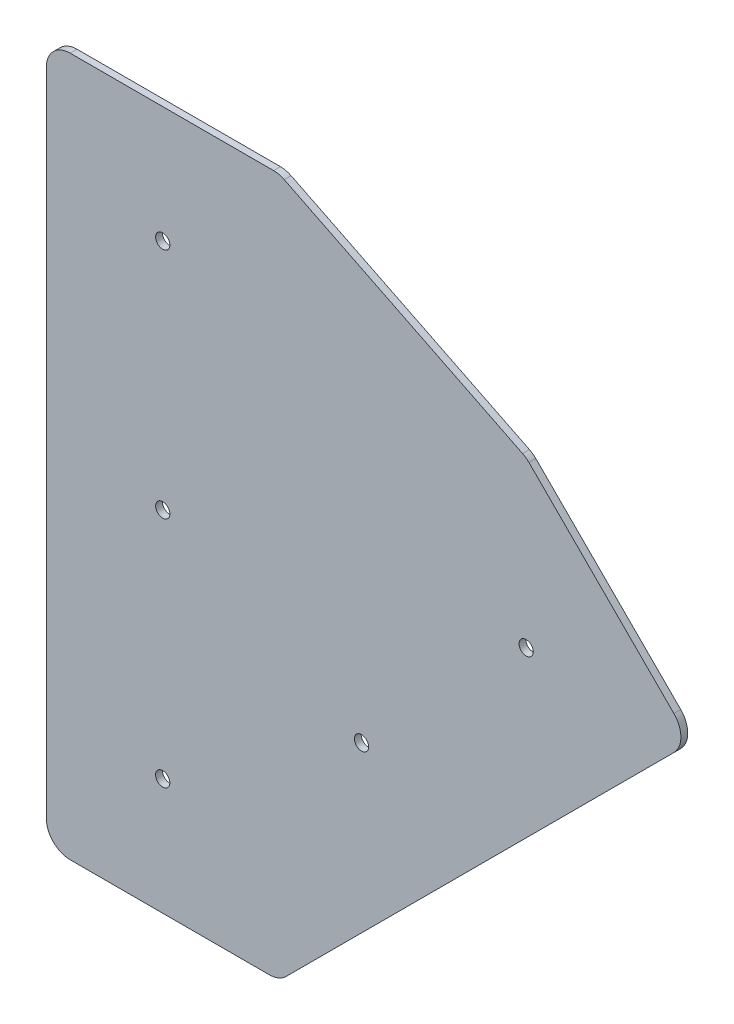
ISO-10303-21;
HEADER;
FILE_DESCRIPTION(('STEP AP214'),'2;1');
FILE_NAME('part.step','',(''),(''),'','','');
FILE_SCHEMA(('AUTOMOTIVE_DESIGN { 1 0 10303 214 1 1 1 1 }'));
ENDSEC;
DATA;
#1=APPLICATION_CONTEXT('core data for automotive mechanical design processes');
#2=APPLICATION_PROTOCOL_DEFINITION('international standard','automotive_design',2000,#1);
#3=PRODUCT_CONTEXT('',#1,'mechanical');
#4=PRODUCT('Part','Part','',(#3));
#5=PRODUCT_RELATED_PRODUCT_CATEGORY('part','',(#4));
#6=PRODUCT_DEFINITION_FORMATION('','',#4);
#7=PRODUCT_DEFINITION_CONTEXT('part definition',#1,'design');
#8=PRODUCT_DEFINITION('design','',#6,#7);
#9=PRODUCT_DEFINITION_SHAPE('','',#8);
#10=(LENGTH_UNIT() NAMED_UNIT(*) SI_UNIT(.MILLI.,.METRE.));
#11=(NAMED_UNIT(*) PLANE_ANGLE_UNIT() SI_UNIT($,.RADIAN.));
#12=(NAMED_UNIT(*) SI_UNIT($,.STERADIAN.) SOLID_ANGLE_UNIT());
#13=UNCERTAINTY_MEASURE_WITH_UNIT(LENGTH_MEASURE(1.E-05),#10,'distance_accuracy_value','');
#14=(GEOMETRIC_REPRESENTATION_CONTEXT(3) GLOBAL_UNCERTAINTY_ASSIGNED_CONTEXT((#13)) GLOBAL_UNIT_ASSIGNED_CONTEXT((#10,
#11,#12)) REPRESENTATION_CONTEXT('',''));
#15=CARTESIAN_POINT('',(0.,0.,0.));
#16=DIRECTION('',(0.,0.,1.));
#17=DIRECTION('',(1.,0.,0.));
#18=AXIS2_PLACEMENT_3D('',#15,#16,#17);
#19=CARTESIAN_POINT('',(111.8696307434,132.9358118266,0.));
#20=DIRECTION('',(-0.707106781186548,-0.707106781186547,0.));
#21=DIRECTION('',(0.707106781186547,-0.707106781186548,0.));
#22=AXIS2_PLACEMENT_3D('',#19,#20,#21);
#23=PLANE('',#22);
#24=DIRECTION('',(0.,0.,-1.));
#25=VECTOR('',#24,1.);
#26=CARTESIAN_POINT('',(111.869630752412,132.935811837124,0.79375));
#27=LINE('',#26,#25);
#28=CARTESIAN_POINT('',(111.869630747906,132.935811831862,0.));
#29=VERTEX_POINT('',#28);
#30=CARTESIAN_POINT('',(111.869630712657,132.93581180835,1.5875));
#31=VERTEX_POINT('',#30);
#32=EDGE_CURVE('E158',#29,#31,#27,.F.);
#33=ORIENTED_EDGE('',*,*,#32,.T.);
#34=DIRECTION('',(-0.707106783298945,0.70710677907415,0.));
#35=VECTOR('',#34,1.);
#36=CARTESIAN_POINT('',(145.461359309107,99.344083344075,1.5875));
#37=LINE('',#36,#35);
#38=CARTESIAN_POINT('',(145.461359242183,99.3440833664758,1.5875));
#39=VERTEX_POINT('',#38);
#40=EDGE_CURVE('E192',#39,#31,#37,.T.);
#41=ORIENTED_EDGE('',*,*,#40,.F.);
#42=DIRECTION('',(0.,0.,1.));
#43=VECTOR('',#42,1.);
#44=CARTESIAN_POINT('',(145.461359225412,99.3440833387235,0.79375));
#45=LINE('',#44,#43);
#46=CARTESIAN_POINT('',(145.461359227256,99.3440833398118,0.));
#47=VERTEX_POINT('',#46);
#48=EDGE_CURVE('E130',#39,#47,#45,.F.);
#49=ORIENTED_EDGE('',*,*,#48,.T.);
#50=DIRECTION('',(0.707106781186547,-0.707106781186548,0.));
#51=VECTOR('',#50,1.);
#52=CARTESIAN_POINT('',(111.8696307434,132.9358118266,0.));
#53=LINE('',#52,#51);
#54=EDGE_CURVE('E211',#47,#29,#53,.F.);
#55=ORIENTED_EDGE('',*,*,#54,.T.);
#56=EDGE_LOOP('',(#33,#41,#49,#55));
#57=FACE_BOUND('',#56,.T.);
#58=ADVANCED_FACE('F15',(#57),#23,.F.);
#59=CARTESIAN_POINT('',(107.9407687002,129.0069497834,1.5875));
#60=DIRECTION('',(0.,0.,-1.));
#61=DIRECTION('',(0.,1.,0.));
#62=AXIS2_PLACEMENT_3D('',#59,#60,#61);
#63=CYLINDRICAL_SURFACE('',#62,5.55625000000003);
#64=ORIENTED_EDGE('',*,*,#32,.F.);
#65=CARTESIAN_POINT('',(107.9407687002,129.0069497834,0.));
#66=DIRECTION('',(0.,0.,-1.));
#67=DIRECTION('',(0.,1.,0.));
#68=AXIS2_PLACEMENT_3D('',#65,#66,#67);
#69=CIRCLE('',#68,5.55625000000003);
#70=CARTESIAN_POINT('',(110.406036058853,133.986344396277,0.));
#71=VERTEX_POINT('',#70);
#72=EDGE_CURVE('E208',#29,#71,#69,.F.);
#73=ORIENTED_EDGE('',*,*,#72,.T.);
#74=DIRECTION('',(0.,0.,1.));
#75=VECTOR('',#74,1.);
#76=CARTESIAN_POINT('',(110.4060360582,133.9863443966,0.79375));
#77=LINE('',#76,#75);
#78=CARTESIAN_POINT('',(110.40603606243,133.986344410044,1.5875));
#79=VERTEX_POINT('',#78);
#80=EDGE_CURVE('E155',#71,#79,#77,.T.);
#81=ORIENTED_EDGE('',*,*,#80,.T.);
#82=CARTESIAN_POINT('',(107.9407687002,129.0069497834,1.5875));
#83=DIRECTION('',(0.,0.,-1.));
#84=DIRECTION('',(0.,1.,0.));
#85=AXIS2_PLACEMENT_3D('',#82,#83,#84);
#86=CIRCLE('',#85,5.55625000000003);
#87=EDGE_CURVE('E190',#31,#79,#86,.F.);
#88=ORIENTED_EDGE('',*,*,#87,.F.);
#89=EDGE_LOOP('',(#64,#73,#81,#88));
#90=FACE_BOUND('',#89,.T.);
#91=ADVANCED_FACE('F294',(#90),#63,.T.);
#92=CARTESIAN_POINT('',(55.1401436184,161.3481446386,0.));
#93=DIRECTION('',(-0.443692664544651,-0.896179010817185,0.));
#94=DIRECTION('',(0.896179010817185,-0.443692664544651,0.));
#95=AXIS2_PLACEMENT_3D('',#92,#93,#94);
#96=PLANE('',#95);
#97=ORIENTED_EDGE('',*,*,#80,.F.);
#98=DIRECTION('',(0.896179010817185,-0.443692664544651,0.));
#99=VECTOR('',#98,1.);
#100=CARTESIAN_POINT('',(55.1401436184,161.3481446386,0.));
#101=LINE('',#100,#99);
#102=CARTESIAN_POINT('',(55.1401436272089,161.348144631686,0.));
#103=VERTEX_POINT('',#102);
#104=EDGE_CURVE('E206',#71,#103,#101,.F.);
#105=ORIENTED_EDGE('',*,*,#104,.T.);
#106=DIRECTION('',(0.,0.,-1.));
#107=VECTOR('',#106,1.);
#108=CARTESIAN_POINT('',(55.1401436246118,161.34814463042,0.79375));
#109=LINE('',#108,#107);
#110=CARTESIAN_POINT('',(55.1401436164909,161.34814461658,1.5875));
#111=VERTEX_POINT('',#110);
#112=EDGE_CURVE('E103',#103,#111,#109,.F.);
#113=ORIENTED_EDGE('',*,*,#112,.T.);
#114=DIRECTION('',(-0.896179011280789,0.443692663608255,0.));
#115=VECTOR('',#114,1.);
#116=CARTESIAN_POINT('',(110.406036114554,133.986344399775,1.5875));
#117=LINE('',#116,#115);
#118=EDGE_CURVE('E188',#79,#111,#117,.T.);
#119=ORIENTED_EDGE('',*,*,#118,.F.);
#120=EDGE_LOOP('',(#97,#105,#113,#119));
#121=FACE_BOUND('',#120,.T.);
#122=ADVANCED_FACE('F293',(#121),#96,.F.);
#123=CARTESIAN_POINT('',(52.6748762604,156.36875,1.5875));
#124=DIRECTION('',(0.,0.,-1.));
#125=DIRECTION('',(0.,1.,0.));
#126=AXIS2_PLACEMENT_3D('',#123,#124,#125);
#127=CYLINDRICAL_SURFACE('',#126,5.55625);
#128=ORIENTED_EDGE('',*,*,#112,.F.);
#129=CARTESIAN_POINT('',(52.6748762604,156.36875,0.));
#130=DIRECTION('',(0.,0.,-1.));
#131=DIRECTION('',(0.,1.,0.));
#132=AXIS2_PLACEMENT_3D('',#129,#130,#131);
#133=CIRCLE('',#132,5.55625);
#134=CARTESIAN_POINT('',(52.6748762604,161.925,0.));
#135=VERTEX_POINT('',#134);
#136=EDGE_CURVE('E19',#103,#135,#133,.F.);
#137=ORIENTED_EDGE('',*,*,#136,.T.);
#138=DIRECTION('',(0.,0.,1.));
#139=VECTOR('',#138,1.);
#140=CARTESIAN_POINT('',(52.6748762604,161.925,0.79375));
#141=LINE('',#140,#139);
#142=CARTESIAN_POINT('',(52.6748762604,161.925,1.5875));
#143=VERTEX_POINT('',#142);
#144=EDGE_CURVE('E110',#135,#143,#141,.T.);
#145=ORIENTED_EDGE('',*,*,#144,.T.);
#146=CARTESIAN_POINT('',(52.6748762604,156.36875,1.5875));
#147=DIRECTION('',(0.,0.,-1.));
#148=DIRECTION('',(0.,1.,0.));
#149=AXIS2_PLACEMENT_3D('',#146,#147,#148);
#150=CIRCLE('',#149,5.55625);
#151=EDGE_CURVE('E186',#111,#143,#150,.F.);
#152=ORIENTED_EDGE('',*,*,#151,.F.);
#153=EDGE_LOOP('',(#128,#137,#145,#152));
#154=FACE_BOUND('',#153,.T.);
#155=ADVANCED_FACE('F128',(#154),#127,.T.);
#156=CARTESIAN_POINT('',(5.55625,161.925,1.5875));
#157=DIRECTION('',(0.,-1.,0.));
#158=DIRECTION('',(0.,0.,-1.));
#159=AXIS2_PLACEMENT_3D('',#156,#157,#158);
#160=PLANE('',#159);
#161=ORIENTED_EDGE('',*,*,#144,.F.);
#162=DIRECTION('',(-1.,0.,0.));
#163=VECTOR('',#162,1.);
#164=CARTESIAN_POINT('',(73.9856398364,161.925,0.));
#165=LINE('',#164,#163);
#166=CARTESIAN_POINT('',(5.5562500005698,161.925,0.));
#167=VERTEX_POINT('',#166);
#168=EDGE_CURVE('E114',#135,#167,#165,.T.);
#169=ORIENTED_EDGE('',*,*,#168,.T.);
#170=DIRECTION('',(0.,0.,-1.));
#171=VECTOR('',#170,1.);
#172=CARTESIAN_POINT('',(5.5562500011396,161.925,0.79375));
#173=LINE('',#172,#171);
#174=CARTESIAN_POINT('',(5.5562500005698,161.925,1.5875));
#175=VERTEX_POINT('',#174);
#176=EDGE_CURVE('E116',#167,#175,#173,.F.);
#177=ORIENTED_EDGE('',*,*,#176,.T.);
#178=DIRECTION('',(-1.,0.,0.));
#179=VECTOR('',#178,1.);
#180=CARTESIAN_POINT('',(73.9856398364,161.925,1.5875));
#181=LINE('',#180,#179);
#182=EDGE_CURVE('E115',#143,#175,#181,.T.);
#183=ORIENTED_EDGE('',*,*,#182,.F.);
#184=EDGE_LOOP('',(#161,#169,#177,#183));
#185=FACE_BOUND('',#184,.T.);
#186=ADVANCED_FACE('F112',(#185),#160,.F.);
#187=CARTESIAN_POINT('',(5.55625,156.36875,1.5875));
#188=DIRECTION('',(0.,0.,-1.));
#189=DIRECTION('',(0.,1.,0.));
#190=AXIS2_PLACEMENT_3D('',#187,#188,#189);
#191=CYLINDRICAL_SURFACE('',#190,5.55625);
#192=ORIENTED_EDGE('',*,*,#176,.F.);
#193=CARTESIAN_POINT('',(5.55625,156.36875,0.));
#194=DIRECTION('',(0.,0.,-1.));
#195=DIRECTION('',(0.,1.,0.));
#196=AXIS2_PLACEMENT_3D('',#193,#194,#195);
#197=CIRCLE('',#196,5.55625);
#198=CARTESIAN_POINT('',(0.,156.36875,0.));
#199=VERTEX_POINT('',#198);
#200=EDGE_CURVE('E126',#167,#199,#197,.F.);
#201=ORIENTED_EDGE('',*,*,#200,.T.);
#202=DIRECTION('',(0.,0.,1.));
#203=VECTOR('',#202,1.);
#204=CARTESIAN_POINT('',(0.,156.36875,0.79375));
#205=LINE('',#204,#203);
#206=CARTESIAN_POINT('',(0.,156.36875,1.5875));
#207=VERTEX_POINT('',#206);
#208=EDGE_CURVE('E150',#199,#207,#205,.T.);
#209=ORIENTED_EDGE('',*,*,#208,.T.);
#210=CARTESIAN_POINT('',(5.55625,156.36875,1.5875));
#211=DIRECTION('',(0.,0.,-1.));
#212=DIRECTION('',(0.,1.,0.));
#213=AXIS2_PLACEMENT_3D('',#210,#211,#212);
#214=CIRCLE('',#213,5.55625);
#215=EDGE_CURVE('E184',#175,#207,#214,.F.);
#216=ORIENTED_EDGE('',*,*,#215,.F.);
#217=EDGE_LOOP('',(#192,#201,#209,#216));
#218=FACE_BOUND('',#217,.T.);
#219=ADVANCED_FACE('F288',(#218),#191,.T.);
#220=CARTESIAN_POINT('',(0.,5.55625,1.5875));
#221=DIRECTION('',(1.,0.,0.));
#222=DIRECTION('',(0.,0.,-1.));
#223=AXIS2_PLACEMENT_3D('',#220,#221,#222);
#224=PLANE('',#223);
#225=DIRECTION('',(0.,0.,-1.));
#226=VECTOR('',#225,1.);
#227=CARTESIAN_POINT('',(0.,5.55624999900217,0.79375));
#228=LINE('',#227,#226);
#229=CARTESIAN_POINT('',(0.,5.55624999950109,0.));
#230=VERTEX_POINT('',#229);
#231=CARTESIAN_POINT('',(0.,5.55624999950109,1.5875));
#232=VERTEX_POINT('',#231);
#233=EDGE_CURVE('E147',#230,#232,#228,.F.);
#234=ORIENTED_EDGE('',*,*,#233,.T.);
#235=DIRECTION('',(0.,-1.,0.));
#236=VECTOR('',#235,1.);
#237=CARTESIAN_POINT('',(0.,80.9625,1.5875));
#238=LINE('',#237,#236);
#239=EDGE_CURVE('E183',#207,#232,#238,.T.);
#240=ORIENTED_EDGE('',*,*,#239,.F.);
#241=ORIENTED_EDGE('',*,*,#208,.F.);
#242=DIRECTION('',(0.,-1.,0.));
#243=VECTOR('',#242,1.);
#244=CARTESIAN_POINT('',(0.,80.9625,0.));
#245=LINE('',#244,#243);
#246=EDGE_CURVE('E225',#199,#230,#245,.T.);
#247=ORIENTED_EDGE('',*,*,#246,.T.);
#248=EDGE_LOOP('',(#234,#240,#241,#247));
#249=FACE_BOUND('',#248,.T.);
#250=ADVANCED_FACE('F286',(#249),#224,.F.);
#251=CARTESIAN_POINT('',(5.55625,5.55625,1.5875));
#252=DIRECTION('',(0.,0.,-1.));
#253=DIRECTION('',(0.,1.,0.));
#254=AXIS2_PLACEMENT_3D('',#251,#252,#253);
#255=CYLINDRICAL_SURFACE('',#254,5.55625);
#256=ORIENTED_EDGE('',*,*,#233,.F.);
#257=CARTESIAN_POINT('',(5.55625,5.55625,0.));
#258=DIRECTION('',(0.,0.,-1.));
#259=DIRECTION('',(0.,1.,0.));
#260=AXIS2_PLACEMENT_3D('',#257,#258,#259);
#261=CIRCLE('',#260,5.55625);
#262=CARTESIAN_POINT('',(5.55625,0.,0.));
#263=VERTEX_POINT('',#262);
#264=EDGE_CURVE('E223',#230,#263,#261,.F.);
#265=ORIENTED_EDGE('',*,*,#264,.T.);
#266=DIRECTION('',(0.,0.,1.));
#267=VECTOR('',#266,1.);
#268=CARTESIAN_POINT('',(5.55625,0.,0.79375));
#269=LINE('',#268,#267);
#270=CARTESIAN_POINT('',(5.55625,0.,1.5875));
#271=VERTEX_POINT('',#270);
#272=EDGE_CURVE('E144',#263,#271,#269,.T.);
#273=ORIENTED_EDGE('',*,*,#272,.T.);
#274=CARTESIAN_POINT('',(5.55625,5.55625,1.5875));
#275=DIRECTION('',(0.,0.,-1.));
#276=DIRECTION('',(0.,1.,0.));
#277=AXIS2_PLACEMENT_3D('',#274,#275,#276);
#278=CIRCLE('',#277,5.55625);
#279=EDGE_CURVE('E181',#232,#271,#278,.F.);
#280=ORIENTED_EDGE('',*,*,#279,.F.);
#281=EDGE_LOOP('',(#256,#265,#273,#280));
#282=FACE_BOUND('',#281,.T.);
#283=ADVANCED_FACE('F283',(#282),#255,.T.);
#284=CARTESIAN_POINT('',(5.55625,0.,0.));
#285=DIRECTION('',(0.,1.,0.));
#286=DIRECTION('',(0.,0.,1.));
#287=AXIS2_PLACEMENT_3D('',#284,#285,#286);
#288=PLANE('',#287);
#289=ORIENTED_EDGE('',*,*,#272,.F.);
#290=DIRECTION('',(1.,0.,0.));
#291=VECTOR('',#290,1.);
#292=CARTESIAN_POINT('',(73.9856398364,0.,0.));
#293=LINE('',#292,#291);
#294=CARTESIAN_POINT('',(51.6735258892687,0.,0.));
#295=VERTEX_POINT('',#294);
#296=EDGE_CURVE('E222',#263,#295,#293,.T.);
#297=ORIENTED_EDGE('',*,*,#296,.T.);
#298=DIRECTION('',(0.,0.,-1.));
#299=VECTOR('',#298,1.);
#300=CARTESIAN_POINT('',(51.6735258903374,0.,0.79375));
#301=LINE('',#300,#299);
#302=CARTESIAN_POINT('',(51.6735258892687,0.,1.5875));
#303=VERTEX_POINT('',#302);
#304=EDGE_CURVE('E141',#295,#303,#301,.F.);
#305=ORIENTED_EDGE('',*,*,#304,.T.);
#306=DIRECTION('',(1.,0.,0.));
#307=VECTOR('',#306,1.);
#308=CARTESIAN_POINT('',(73.9856398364,0.,1.5875));
#309=LINE('',#308,#307);
#310=EDGE_CURVE('E180',#271,#303,#309,.T.);
#311=ORIENTED_EDGE('',*,*,#310,.F.);
#312=EDGE_LOOP('',(#289,#297,#305,#311));
#313=FACE_BOUND('',#312,.T.);
#314=ADVANCED_FACE('F238',(#313),#288,.F.);
#315=CARTESIAN_POINT('',(51.6735258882,5.55625,1.5875));
#316=DIRECTION('',(0.,0.,-1.));
#317=DIRECTION('',(0.,1.,0.));
#318=AXIS2_PLACEMENT_3D('',#315,#316,#317);
#319=CYLINDRICAL_SURFACE('',#318,5.55625000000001);
#320=ORIENTED_EDGE('',*,*,#304,.F.);
#321=CARTESIAN_POINT('',(51.6735258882,5.55625,0.));
#322=DIRECTION('',(0.,0.,-1.));
#323=DIRECTION('',(0.,1.,0.));
#324=AXIS2_PLACEMENT_3D('',#321,#322,#323);
#325=CIRCLE('',#324,5.55625000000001);
#326=CARTESIAN_POINT('',(55.60238795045,1.62738795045,0.));
#327=VERTEX_POINT('',#326);
#328=EDGE_CURVE('E219',#295,#327,#325,.F.);
#329=ORIENTED_EDGE('',*,*,#328,.T.);
#330=DIRECTION('',(0.,0.,1.));
#331=VECTOR('',#330,1.);
#332=CARTESIAN_POINT('',(55.6023879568,1.6273879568,0.79375));
#333=LINE('',#332,#331);
#334=CARTESIAN_POINT('',(55.6023879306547,1.62738796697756,1.5875));
#335=VERTEX_POINT('',#334);
#336=EDGE_CURVE('E135',#327,#335,#333,.T.);
#337=ORIENTED_EDGE('',*,*,#336,.T.);
#338=CARTESIAN_POINT('',(51.6735258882,5.55625,1.5875));
#339=DIRECTION('',(0.,0.,-1.));
#340=DIRECTION('',(0.,1.,0.));
#341=AXIS2_PLACEMENT_3D('',#338,#339,#340);
#342=CIRCLE('',#341,5.55625000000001);
#343=EDGE_CURVE('E178',#303,#335,#342,.F.);
#344=ORIENTED_EDGE('',*,*,#343,.F.);
#345=EDGE_LOOP('',(#320,#329,#337,#344));
#346=FACE_BOUND('',#345,.T.);
#347=ADVANCED_FACE('F242',(#346),#319,.T.);
#348=CARTESIAN_POINT('',(145.4613592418,91.4863592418,0.));
#349=DIRECTION('',(-0.707106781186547,0.707106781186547,0.));
#350=DIRECTION('',(-0.707106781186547,-0.707106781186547,0.));
#351=AXIS2_PLACEMENT_3D('',#348,#349,#350);
#352=PLANE('',#351);
#353=ORIENTED_EDGE('',*,*,#336,.F.);
#354=DIRECTION('',(-0.707106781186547,-0.707106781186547,0.));
#355=VECTOR('',#354,1.);
#356=CARTESIAN_POINT('',(145.4613592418,91.4863592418,0.));
#357=LINE('',#356,#355);
#358=CARTESIAN_POINT('',(145.461359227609,91.4863592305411,0.));
#359=VERTEX_POINT('',#358);
#360=EDGE_CURVE('E217',#327,#359,#357,.F.);
#361=ORIENTED_EDGE('',*,*,#360,.T.);
#362=DIRECTION('',(0.,0.,-1.));
#363=VECTOR('',#362,1.);
#364=CARTESIAN_POINT('',(145.461359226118,91.4863592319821,0.79375));
#365=LINE('',#364,#363);
#366=CARTESIAN_POINT('',(145.461359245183,91.4863592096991,1.5875));
#367=VERTEX_POINT('',#366);
#368=EDGE_CURVE('E129',#359,#367,#365,.F.);
#369=ORIENTED_EDGE('',*,*,#368,.T.);
#370=DIRECTION('',(0.707106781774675,0.70710678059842,0.));
#371=VECTOR('',#370,1.);
#372=CARTESIAN_POINT('',(55.6023879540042,1.62738802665,1.5875));
#373=LINE('',#372,#371);
#374=EDGE_CURVE('E34',#335,#367,#373,.T.);
#375=ORIENTED_EDGE('',*,*,#374,.F.);
#376=EDGE_LOOP('',(#353,#361,#369,#375));
#377=FACE_BOUND('',#376,.T.);
#378=ADVANCED_FACE('F244',(#377),#352,.F.);
#379=CARTESIAN_POINT('',(141.5324971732,95.415221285,1.5875));
#380=DIRECTION('',(0.,0.,-1.));
#381=DIRECTION('',(0.,1.,0.));
#382=AXIS2_PLACEMENT_3D('',#379,#380,#381);
#383=CYLINDRICAL_SURFACE('',#382,5.55625000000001);
#384=ORIENTED_EDGE('',*,*,#368,.F.);
#385=CARTESIAN_POINT('',(141.5324971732,95.415221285,0.));
#386=DIRECTION('',(0.,0.,-1.));
#387=DIRECTION('',(0.,1.,0.));
#388=AXIS2_PLACEMENT_3D('',#385,#386,#387);
#389=CIRCLE('',#388,5.55625000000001);
#390=EDGE_CURVE('E214',#359,#47,#389,.F.);
#391=ORIENTED_EDGE('',*,*,#390,.T.);
#392=ORIENTED_EDGE('',*,*,#48,.F.);
#393=CARTESIAN_POINT('',(141.5324971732,95.415221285,1.5875));
#394=DIRECTION('',(0.,0.,-1.));
#395=DIRECTION('',(0.,1.,0.));
#396=AXIS2_PLACEMENT_3D('',#393,#394,#395);
#397=CIRCLE('',#396,5.55625000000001);
#398=EDGE_CURVE('E175',#367,#39,#397,.F.);
#399=ORIENTED_EDGE('',*,*,#398,.F.);
#400=EDGE_LOOP('',(#384,#391,#392,#399));
#401=FACE_BOUND('',#400,.T.);
#402=ADVANCED_FACE('F246',(#401),#383,.T.);
#403=CARTESIAN_POINT('',(111.224132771,95.415221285,0.));
#404=DIRECTION('',(0.,0.,1.));
#405=DIRECTION('',(1.,0.,0.));
#406=AXIS2_PLACEMENT_3D('',#403,#404,#405);
#407=CYLINDRICAL_SURFACE('',#406,1.65100000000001);
#408=CARTESIAN_POINT('',(111.224132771,95.415221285,1.5875));
#409=DIRECTION('',(0.,0.,1.));
#410=DIRECTION('',(1.,0.,0.));
#411=AXIS2_PLACEMENT_3D('',#408,#409,#410);
#412=CIRCLE('',#411,1.65100000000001);
#413=CARTESIAN_POINT('',(112.875132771,95.415221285,1.5875));
#414=VERTEX_POINT('',#413);
#415=EDGE_CURVE('E172',#414,#414,#412,.F.);
#416=ORIENTED_EDGE('',*,*,#415,.F.);
#417=EDGE_LOOP('',(#416));
#418=FACE_BOUND('',#417,.T.);
#419=CARTESIAN_POINT('',(111.224132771,95.415221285,0.));
#420=DIRECTION('',(0.,0.,1.));
#421=DIRECTION('',(1.,0.,0.));
#422=AXIS2_PLACEMENT_3D('',#419,#420,#421);
#423=CIRCLE('',#422,1.65100000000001);
#424=CARTESIAN_POINT('',(112.875132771,95.415221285,0.));
#425=VERTEX_POINT('',#424);
#426=EDGE_CURVE('E203',#425,#425,#423,.F.);
#427=ORIENTED_EDGE('',*,*,#426,.T.);
#428=EDGE_LOOP('',(#427));
#429=FACE_BOUND('',#428,.T.);
#430=ADVANCED_FACE('F253',(#418,#429),#407,.F.);
#431=CARTESIAN_POINT('',(73.058044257,57.249132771,0.));
#432=DIRECTION('',(0.,0.,1.));
#433=DIRECTION('',(1.,0.,0.));
#434=AXIS2_PLACEMENT_3D('',#431,#432,#433);
#435=CYLINDRICAL_SURFACE('',#434,1.65100000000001);
#436=CARTESIAN_POINT('',(73.058044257,57.249132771,1.5875));
#437=DIRECTION('',(0.,0.,1.));
#438=DIRECTION('',(1.,0.,0.));
#439=AXIS2_PLACEMENT_3D('',#436,#437,#438);
#440=CIRCLE('',#439,1.65100000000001);
#441=CARTESIAN_POINT('',(74.709044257,57.249132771,1.5875));
#442=VERTEX_POINT('',#441);
#443=EDGE_CURVE('E169',#442,#442,#440,.F.);
#444=ORIENTED_EDGE('',*,*,#443,.F.);
#445=EDGE_LOOP('',(#444));
#446=FACE_BOUND('',#445,.T.);
#447=CARTESIAN_POINT('',(73.058044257,57.249132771,0.));
#448=DIRECTION('',(0.,0.,1.));
#449=DIRECTION('',(1.,0.,0.));
#450=AXIS2_PLACEMENT_3D('',#447,#448,#449);
#451=CIRCLE('',#450,1.65100000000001);
#452=CARTESIAN_POINT('',(74.709044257,57.249132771,0.));
#453=VERTEX_POINT('',#452);
#454=EDGE_CURVE('E200',#453,#453,#451,.F.);
#455=ORIENTED_EDGE('',*,*,#454,.T.);
#456=EDGE_LOOP('',(#455));
#457=FACE_BOUND('',#456,.T.);
#458=ADVANCED_FACE('F275',(#446,#457),#435,.F.);
#459=CARTESIAN_POINT('',(26.9875,26.9875,0.));
#460=DIRECTION('',(0.,0.,1.));
#461=DIRECTION('',(1.,0.,0.));
#462=AXIS2_PLACEMENT_3D('',#459,#460,#461);
#463=CYLINDRICAL_SURFACE('',#462,1.651);
#464=CARTESIAN_POINT('',(26.9875,26.9875,1.5875));
#465=DIRECTION('',(0.,0.,1.));
#466=DIRECTION('',(1.,0.,0.));
#467=AXIS2_PLACEMENT_3D('',#464,#465,#466);
#468=CIRCLE('',#467,1.651);
#469=CARTESIAN_POINT('',(28.6385,26.9875,1.5875));
#470=VERTEX_POINT('',#469);
#471=EDGE_CURVE('E166',#470,#470,#468,.F.);
#472=ORIENTED_EDGE('',*,*,#471,.F.);
#473=EDGE_LOOP('',(#472));
#474=FACE_BOUND('',#473,.T.);
#475=CARTESIAN_POINT('',(26.9875,26.9875,0.));
#476=DIRECTION('',(0.,0.,1.));
#477=DIRECTION('',(1.,0.,0.));
#478=AXIS2_PLACEMENT_3D('',#475,#476,#477);
#479=CIRCLE('',#478,1.651);
#480=CARTESIAN_POINT('',(28.6385,26.9875,0.));
#481=VERTEX_POINT('',#480);
#482=EDGE_CURVE('E197',#481,#481,#479,.F.);
#483=ORIENTED_EDGE('',*,*,#482,.T.);
#484=EDGE_LOOP('',(#483));
#485=FACE_BOUND('',#484,.T.);
#486=ADVANCED_FACE('F271',(#474,#485),#463,.F.);
#487=CARTESIAN_POINT('',(26.9875,80.9625,0.));
#488=DIRECTION('',(0.,0.,1.));
#489=DIRECTION('',(1.,0.,0.));
#490=AXIS2_PLACEMENT_3D('',#487,#488,#489);
#491=CYLINDRICAL_SURFACE('',#490,1.651);
#492=CARTESIAN_POINT('',(26.9875,80.9625,1.5875));
#493=DIRECTION('',(0.,0.,1.));
#494=DIRECTION('',(1.,0.,0.));
#495=AXIS2_PLACEMENT_3D('',#492,#493,#494);
#496=CIRCLE('',#495,1.651);
#497=CARTESIAN_POINT('',(28.6385,80.9625,1.5875));
#498=VERTEX_POINT('',#497);
#499=EDGE_CURVE('E163',#498,#498,#496,.F.);
#500=ORIENTED_EDGE('',*,*,#499,.F.);
#501=EDGE_LOOP('',(#500));
#502=FACE_BOUND('',#501,.T.);
#503=CARTESIAN_POINT('',(26.9875,80.9625,0.));
#504=DIRECTION('',(0.,0.,1.));
#505=DIRECTION('',(1.,0.,0.));
#506=AXIS2_PLACEMENT_3D('',#503,#504,#505);
#507=CIRCLE('',#506,1.651);
#508=CARTESIAN_POINT('',(28.6385,80.9625,0.));
#509=VERTEX_POINT('',#508);
#510=EDGE_CURVE('E194',#509,#509,#507,.F.);
#511=ORIENTED_EDGE('',*,*,#510,.T.);
#512=EDGE_LOOP('',(#511));
#513=FACE_BOUND('',#512,.T.);
#514=ADVANCED_FACE('F268',(#502,#513),#491,.F.);
#515=CARTESIAN_POINT('',(0.,0.,0.));
#516=DIRECTION('',(0.,0.,1.));
#517=DIRECTION('',(1.,0.,0.));
#518=AXIS2_PLACEMENT_3D('',#515,#516,#517);
#519=PLANE('',#518);
#520=ORIENTED_EDGE('',*,*,#510,.F.);
#521=EDGE_LOOP('',(#520));
#522=FACE_BOUND('',#521,.T.);
#523=ORIENTED_EDGE('',*,*,#482,.F.);
#524=EDGE_LOOP('',(#523));
#525=FACE_BOUND('',#524,.T.);
#526=ORIENTED_EDGE('',*,*,#454,.F.);
#527=EDGE_LOOP('',(#526));
#528=FACE_BOUND('',#527,.T.);
#529=ORIENTED_EDGE('',*,*,#426,.F.);
#530=EDGE_LOOP('',(#529));
#531=FACE_BOUND('',#530,.T.);
#532=CARTESIAN_POINT('',(26.9875,134.9375,0.));
#533=DIRECTION('',(0.,0.,1.));
#534=DIRECTION('',(1.,0.,0.));
#535=AXIS2_PLACEMENT_3D('',#532,#533,#534);
#536=CIRCLE('',#535,1.651);
#537=CARTESIAN_POINT('',(28.6385,134.9375,0.));
#538=VERTEX_POINT('',#537);
#539=EDGE_CURVE('E25',#538,#538,#536,.F.);
#540=ORIENTED_EDGE('',*,*,#539,.F.);
#541=EDGE_LOOP('',(#540));
#542=FACE_BOUND('',#541,.T.);
#543=ORIENTED_EDGE('',*,*,#72,.F.);
#544=ORIENTED_EDGE('',*,*,#54,.F.);
#545=ORIENTED_EDGE('',*,*,#390,.F.);
#546=ORIENTED_EDGE('',*,*,#360,.F.);
#547=ORIENTED_EDGE('',*,*,#328,.F.);
#548=ORIENTED_EDGE('',*,*,#296,.F.);
#549=ORIENTED_EDGE('',*,*,#264,.F.);
#550=ORIENTED_EDGE('',*,*,#246,.F.);
#551=ORIENTED_EDGE('',*,*,#200,.F.);
#552=ORIENTED_EDGE('',*,*,#168,.F.);
#553=ORIENTED_EDGE('',*,*,#136,.F.);
#554=ORIENTED_EDGE('',*,*,#104,.F.);
#555=EDGE_LOOP('',(#543,#544,#545,#546,#547,#548,#549,#550,#551,#552,#553,#554));
#556=FACE_BOUND('',#555,.T.);
#557=ADVANCED_FACE('F121',(#522,#525,#528,#531,#542,#556),#519,.F.);
#558=CARTESIAN_POINT('',(0.,0.,1.5875));
#559=DIRECTION('',(0.,0.,1.));
#560=DIRECTION('',(1.,0.,0.));
#561=AXIS2_PLACEMENT_3D('',#558,#559,#560);
#562=PLANE('',#561);
#563=ORIENTED_EDGE('',*,*,#499,.T.);
#564=EDGE_LOOP('',(#563));
#565=FACE_BOUND('',#564,.T.);
#566=ORIENTED_EDGE('',*,*,#471,.T.);
#567=EDGE_LOOP('',(#566));
#568=FACE_BOUND('',#567,.T.);
#569=ORIENTED_EDGE('',*,*,#443,.T.);
#570=EDGE_LOOP('',(#569));
#571=FACE_BOUND('',#570,.T.);
#572=ORIENTED_EDGE('',*,*,#415,.T.);
#573=EDGE_LOOP('',(#572));
#574=FACE_BOUND('',#573,.T.);
#575=CARTESIAN_POINT('',(26.9875,134.9375,1.5875));
#576=DIRECTION('',(0.,0.,1.));
#577=DIRECTION('',(1.,0.,0.));
#578=AXIS2_PLACEMENT_3D('',#575,#576,#577);
#579=CIRCLE('',#578,1.651);
#580=CARTESIAN_POINT('',(28.6385,134.9375,1.5875));
#581=VERTEX_POINT('',#580);
#582=EDGE_CURVE('E9',#581,#581,#579,.T.);
#583=ORIENTED_EDGE('',*,*,#582,.F.);
#584=EDGE_LOOP('',(#583));
#585=FACE_BOUND('',#584,.T.);
#586=ORIENTED_EDGE('',*,*,#374,.T.);
#587=ORIENTED_EDGE('',*,*,#398,.T.);
#588=ORIENTED_EDGE('',*,*,#40,.T.);
#589=ORIENTED_EDGE('',*,*,#87,.T.);
#590=ORIENTED_EDGE('',*,*,#118,.T.);
#591=ORIENTED_EDGE('',*,*,#151,.T.);
#592=ORIENTED_EDGE('',*,*,#182,.T.);
#593=ORIENTED_EDGE('',*,*,#215,.T.);
#594=ORIENTED_EDGE('',*,*,#239,.T.);
#595=ORIENTED_EDGE('',*,*,#279,.T.);
#596=ORIENTED_EDGE('',*,*,#310,.T.);
#597=ORIENTED_EDGE('',*,*,#343,.T.);
#598=EDGE_LOOP('',(#586,#587,#588,#589,#590,#591,#592,#593,#594,#595,#596,#597));
#599=FACE_BOUND('',#598,.T.);
#600=ADVANCED_FACE('F17',(#565,#568,#571,#574,#585,#599),#562,.T.);
#601=CARTESIAN_POINT('',(26.9875,134.9375,0.));
#602=DIRECTION('',(0.,0.,1.));
#603=DIRECTION('',(1.,0.,0.));
#604=AXIS2_PLACEMENT_3D('',#601,#602,#603);
#605=CYLINDRICAL_SURFACE('',#604,1.651);
#606=ORIENTED_EDGE('',*,*,#539,.T.);
#607=EDGE_LOOP('',(#606));
#608=FACE_BOUND('',#607,.T.);
#609=ORIENTED_EDGE('',*,*,#582,.T.);
#610=EDGE_LOOP('',(#609));
#611=FACE_BOUND('',#610,.T.);
#612=ADVANCED_FACE('F258',(#608,#611),#605,.F.);
#613=CLOSED_SHELL('',(#58,#91,#122,#155,#186,#219,#250,#283,#314,#347,#378,#402,#430,#458,#486,
#514,#557,#600,#612));
#614=MANIFOLD_SOLID_BREP('B1',#613);
#615=ADVANCED_BREP_SHAPE_REPRESENTATION('',(#18,#614),#14);
#616=SHAPE_DEFINITION_REPRESENTATION(#9,#615);
ENDSEC;
END-ISO-10303-21;
